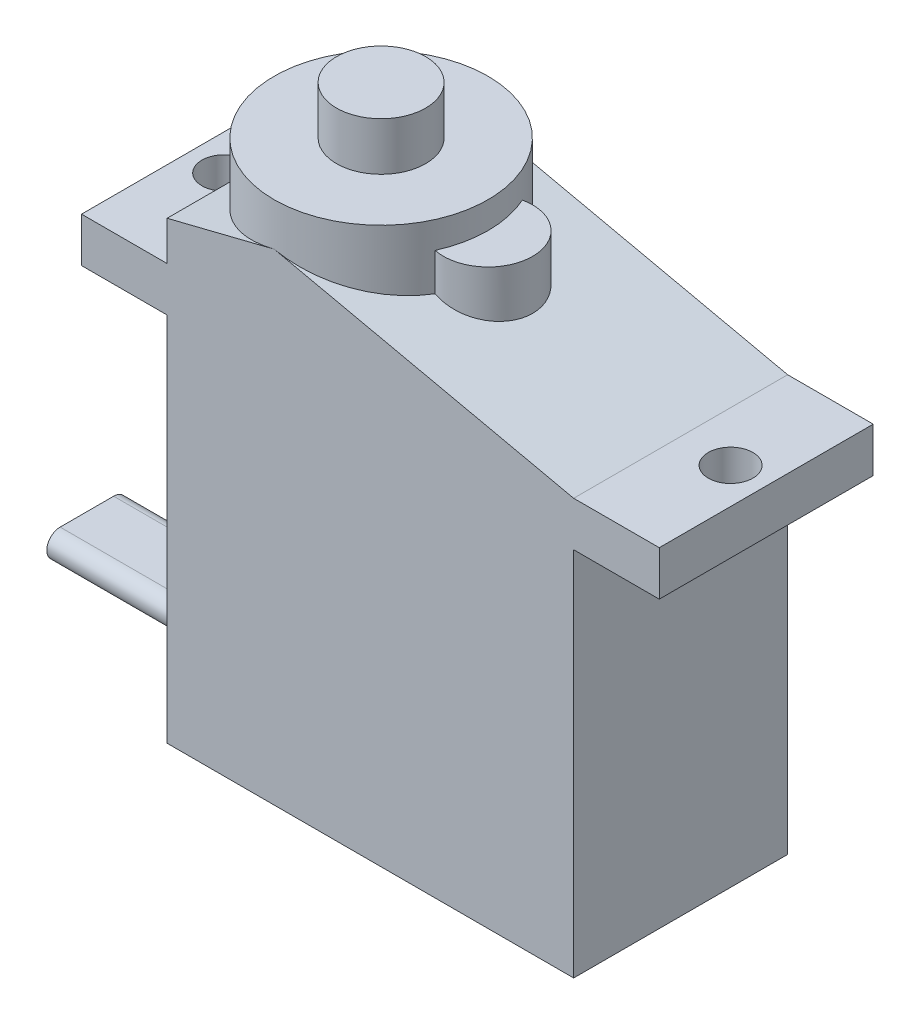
from build123d import *

# Parameters (mm, degrees)
EXTRUSION1_DEPTH        = 12
ESQUISSE2_R             = 1.25
ENL_V_MAT_EXTRU_1_DEPTH = 39.061135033
EXTRUSION5_DEPTH        = 0.5
EXTRUSION6_DEPTH        = 10
BOSS_EXTRU_1_REACH      = 44.073
ESQUISSE8_R             = 6
BOSS_EXTRU_2_REACH      = 43.039
ESQUISSE10_R            = 2.5
BOSS_EXTRU_3_DEPTH      = 2.7


with BuildPart() as part:
    # Esquisse1 → Extrusion1 (new body)
    with BuildSketch(Plane.XY):
        Polygon((27.6, 23.3), (22.8, 23.3), (6, 27), (0, 25.5), (0, 23.3), (-4.8, 23.3), (-4.8, 20.8), (0, 20.8), (0, 0), (22.8, 0), (22.8, 20.8), (27.6, 20.8), align=None)
    extrude(amount=EXTRUSION1_DEPTH)

    # Esquisse2 → Enl_v. mat.-Extru.1 (cut, through all)
    with BuildSketch(Plane(origin=(0, 23.3, 0), x_dir=(1, 0, 0), z_dir=(0, 1, 0))):
        with Locations(Location((-2.8, -6, 0), (0, 0, 270))):
            Circle(ESQUISSE2_R)
        with Locations(Location((25.6, -6, 0), (0, 0, 270))):
            Circle(ESQUISSE2_R)
    extrude(amount=-ENL_V_MAT_EXTRU_1_DEPTH, mode=Mode.SUBTRACT)

    # Esquisse6 → Extrusion5 (add)
    with BuildSketch(Plane.ZY):
        with BuildLine():
            Line((4.5, 3.5), (7.5, 3.5))
            ThreePointArc((7.5, 3.5), (8.75, 2.25), (7.5, 1))
            Line((7.5, 1), (4.5, 1))
            ThreePointArc((4.5, 1), (3.25, 2.25), (4.5, 3.5))
        make_face()
    extrude(amount=EXTRUSION5_DEPTH)

    # Esquisse7 → Extrusion6 (add)
    with BuildSketch(Plane.ZY.offset(0.5)):
        with BuildLine():
            Line((4.5, 1.5), (7.5, 1.5))
            ThreePointArc((7.5, 1.5), (8.25, 2.25), (7.5, 3))
            Line((7.5, 3), (4.5, 3))
            ThreePointArc((4.5, 3), (3.75, 2.25), (4.5, 1.5))
        make_face()
    extrude(amount=EXTRUSION6_DEPTH)

    # Esquisse8 → Boss.-Extru.1 (add, up to next)
    with BuildSketch(Plane.XZ.offset(-29.4), mode=Mode.PRIVATE) as boss_extru_1_sk1:
        with Locations(Location((6, 6, 0), (0, 0, 270))):
            Circle(ESQUISSE8_R)
    boss_extru_1_tool1 = extrude(boss_extru_1_sk1.sketch, amount=BOSS_EXTRU_1_REACH, mode=Mode.PRIVATE) - part.part
    add(boss_extru_1_tool1.solids().sort_by_distance((6, 29.4, 6))[0])

    # Boss.-Extru.2: up to this plane
    boss_extru_2_end = Plane(origin=(6, 27, 12), z_dir=(-0.21508356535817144, -0.9765956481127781, 0))
    # Esquisse9 → Boss.-Extru.2 (add, up to the surface)
    with BuildSketch(Plane(origin=(0, 27.9, 0), x_dir=(-1, 0, 0), z_dir=(0, 1, 0)), mode=Mode.PRIVATE) as boss_extru_2_sk1:
        with BuildLine():
            ThreePointArc((-11.479166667, 8.445144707), (-14.5, 6), (-11.479166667, 3.554855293))
            ThreePointArc((-11.479166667, 3.554855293), (-12, 6), (-11.479166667, 8.445144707))
        make_face()
    boss_extru_2_tool1 = split(extrude(boss_extru_2_sk1.sketch, amount=-BOSS_EXTRU_2_REACH, mode=Mode.PRIVATE), bisect_by=boss_extru_2_end, keep=Keep.BOTH, mode=Mode.PRIVATE)
    add(boss_extru_2_tool1.solids().sort_by_distance((12.961701, 27.9, 6))[0])


with BuildPart() as body_2:
    # Esquisse10 → Boss.-Extru.3 (new body)
    with BuildSketch(Plane(origin=(0, 29.4, 0), x_dir=(1, 0, 0), z_dir=(0, 1, 0))):
        with Locations(Location((6, -6, 0), (0, 0, 90))):
            Circle(ESQUISSE10_R)
    extrude(amount=BOSS_EXTRU_3_DEPTH)


solid = Compound([part.part, body_2.part])
